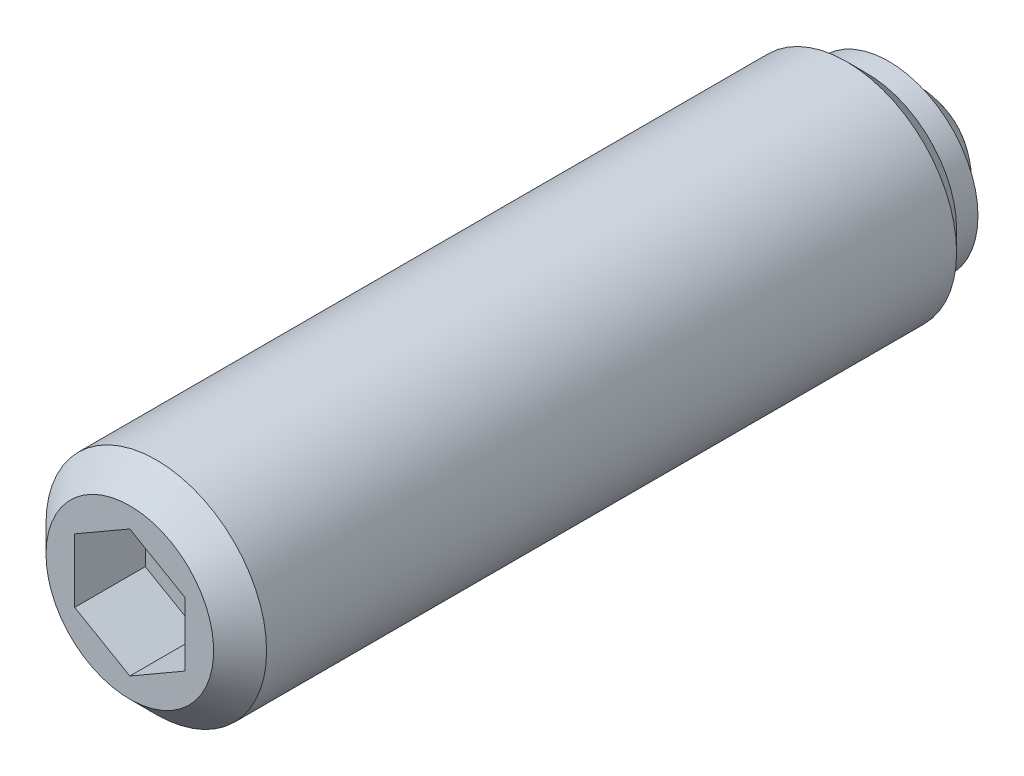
ISO-10303-21;
HEADER;
FILE_DESCRIPTION(('STEP AP214'),'2;1');
FILE_NAME('part.step','',(''),(''),'','','');
FILE_SCHEMA(('AUTOMOTIVE_DESIGN { 1 0 10303 214 1 1 1 1 }'));
ENDSEC;
DATA;
#1=APPLICATION_CONTEXT('core data for automotive mechanical design processes');
#2=APPLICATION_PROTOCOL_DEFINITION('international standard','automotive_design',2000,#1);
#3=PRODUCT_CONTEXT('',#1,'mechanical');
#4=PRODUCT('Part','Part','',(#3));
#5=PRODUCT_RELATED_PRODUCT_CATEGORY('part','',(#4));
#6=PRODUCT_DEFINITION_FORMATION('','',#4);
#7=PRODUCT_DEFINITION_CONTEXT('part definition',#1,'design');
#8=PRODUCT_DEFINITION('design','',#6,#7);
#9=PRODUCT_DEFINITION_SHAPE('','',#8);
#10=(LENGTH_UNIT() NAMED_UNIT(*) SI_UNIT(.MILLI.,.METRE.));
#11=(NAMED_UNIT(*) PLANE_ANGLE_UNIT() SI_UNIT($,.RADIAN.));
#12=(NAMED_UNIT(*) SI_UNIT($,.STERADIAN.) SOLID_ANGLE_UNIT());
#13=UNCERTAINTY_MEASURE_WITH_UNIT(LENGTH_MEASURE(1.E-05),#10,'distance_accuracy_value','');
#14=(GEOMETRIC_REPRESENTATION_CONTEXT(3) GLOBAL_UNCERTAINTY_ASSIGNED_CONTEXT((#13)) GLOBAL_UNIT_ASSIGNED_CONTEXT((#10,
#11,#12)) REPRESENTATION_CONTEXT('',''));
#15=CARTESIAN_POINT('',(0.,0.,0.));
#16=DIRECTION('',(0.,0.,1.));
#17=DIRECTION('',(1.,0.,0.));
#18=AXIS2_PLACEMENT_3D('',#15,#16,#17);
#19=CARTESIAN_POINT('',(0.,0.,33.5));
#20=DIRECTION('',(0.,0.,-1.));
#21=DIRECTION('',(-1.,0.,0.));
#22=AXIS2_PLACEMENT_3D('',#19,#20,#21);
#23=PLANE('',#22);
#24=DIRECTION('',(0.,1.,0.));
#25=VECTOR('',#24,1.);
#26=CARTESIAN_POINT('',(-2.5,-1.44337567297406,33.5));
#27=LINE('',#26,#25);
#28=CARTESIAN_POINT('',(-2.5,-1.44337567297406,33.5));
#29=VERTEX_POINT('',#28);
#30=CARTESIAN_POINT('',(-2.5,1.44337567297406,33.5));
#31=VERTEX_POINT('',#30);
#32=EDGE_CURVE('E80',#29,#31,#27,.T.);
#33=ORIENTED_EDGE('',*,*,#32,.F.);
#34=DIRECTION('',(0.866025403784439,-0.5,0.));
#35=VECTOR('',#34,1.);
#36=CARTESIAN_POINT('',(0.,-2.88675134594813,33.5));
#37=LINE('',#36,#35);
#38=CARTESIAN_POINT('',(0.,-2.88675134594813,33.5));
#39=VERTEX_POINT('',#38);
#40=EDGE_CURVE('E102',#39,#29,#37,.F.);
#41=ORIENTED_EDGE('',*,*,#40,.F.);
#42=DIRECTION('',(-0.866025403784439,-0.5,0.));
#43=VECTOR('',#42,1.);
#44=CARTESIAN_POINT('',(1.25,-2.1650635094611,33.5));
#45=LINE('',#44,#43);
#46=CARTESIAN_POINT('',(2.5,-1.44337567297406,33.5));
#47=VERTEX_POINT('',#46);
#48=EDGE_CURVE('E81',#47,#39,#45,.T.);
#49=ORIENTED_EDGE('',*,*,#48,.F.);
#50=DIRECTION('',(0.,1.,0.));
#51=VECTOR('',#50,1.);
#52=CARTESIAN_POINT('',(2.5,0.,33.5));
#53=LINE('',#52,#51);
#54=CARTESIAN_POINT('',(2.5,1.44337567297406,33.5));
#55=VERTEX_POINT('',#54);
#56=EDGE_CURVE('E64',#55,#47,#53,.F.);
#57=ORIENTED_EDGE('',*,*,#56,.F.);
#58=DIRECTION('',(0.866025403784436,-0.5,0.));
#59=VECTOR('',#58,1.);
#60=CARTESIAN_POINT('',(1.25,2.1650635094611,33.5));
#61=LINE('',#60,#59);
#62=CARTESIAN_POINT('',(0.,2.88675134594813,33.5));
#63=VERTEX_POINT('',#62);
#64=EDGE_CURVE('E67',#63,#55,#61,.T.);
#65=ORIENTED_EDGE('',*,*,#64,.F.);
#66=DIRECTION('',(0.866025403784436,0.5,0.));
#67=VECTOR('',#66,1.);
#68=CARTESIAN_POINT('',(-2.5,1.44337567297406,33.5));
#69=LINE('',#68,#67);
#70=EDGE_CURVE('E69',#31,#63,#69,.T.);
#71=ORIENTED_EDGE('',*,*,#70,.F.);
#72=EDGE_LOOP('',(#33,#41,#49,#57,#65,#71));
#73=FACE_BOUND('',#72,.T.);
#74=ADVANCED_FACE('F14',(#73),#23,.F.);
#75=CARTESIAN_POINT('',(-2.5,-1.44337567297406,33.5));
#76=DIRECTION('',(1.,0.,0.));
#77=DIRECTION('',(0.,0.,-1.));
#78=AXIS2_PLACEMENT_3D('',#75,#76,#77);
#79=PLANE('',#78);
#80=ORIENTED_EDGE('',*,*,#32,.T.);
#81=DIRECTION('',(0.,0.,-1.));
#82=VECTOR('',#81,1.);
#83=CARTESIAN_POINT('',(-2.5,1.44337567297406,33.5));
#84=LINE('',#83,#82);
#85=CARTESIAN_POINT('',(-2.5,1.44337567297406,36.7));
#86=VERTEX_POINT('',#85);
#87=EDGE_CURVE('E79',#86,#31,#84,.T.);
#88=ORIENTED_EDGE('',*,*,#87,.F.);
#89=DIRECTION('',(0.,1.,0.));
#90=VECTOR('',#89,1.);
#91=CARTESIAN_POINT('',(-2.5,0.,36.7));
#92=LINE('',#91,#90);
#93=CARTESIAN_POINT('',(-2.5,-1.44337567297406,36.7));
#94=VERTEX_POINT('',#93);
#95=EDGE_CURVE('E84',#86,#94,#92,.F.);
#96=ORIENTED_EDGE('',*,*,#95,.T.);
#97=DIRECTION('',(0.,0.,-1.));
#98=VECTOR('',#97,1.);
#99=CARTESIAN_POINT('',(-2.5,-1.44337567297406,33.5));
#100=LINE('',#99,#98);
#101=EDGE_CURVE('E96',#29,#94,#100,.F.);
#102=ORIENTED_EDGE('',*,*,#101,.F.);
#103=EDGE_LOOP('',(#80,#88,#96,#102));
#104=FACE_BOUND('',#103,.T.);
#105=ADVANCED_FACE('F169',(#104),#79,.T.);
#106=CARTESIAN_POINT('',(0.,-2.88675134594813,33.5));
#107=DIRECTION('',(0.5,0.866025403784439,0.));
#108=DIRECTION('',(0.866025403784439,-0.5,0.));
#109=AXIS2_PLACEMENT_3D('',#106,#107,#108);
#110=PLANE('',#109);
#111=ORIENTED_EDGE('',*,*,#40,.T.);
#112=ORIENTED_EDGE('',*,*,#101,.T.);
#113=DIRECTION('',(0.866025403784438,-0.5,0.));
#114=VECTOR('',#113,1.);
#115=CARTESIAN_POINT('',(-2.5,-1.44337567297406,36.7));
#116=LINE('',#115,#114);
#117=CARTESIAN_POINT('',(0.,-2.88675134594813,36.7));
#118=VERTEX_POINT('',#117);
#119=EDGE_CURVE('E85',#94,#118,#116,.T.);
#120=ORIENTED_EDGE('',*,*,#119,.T.);
#121=DIRECTION('',(0.,0.,-1.));
#122=VECTOR('',#121,1.);
#123=CARTESIAN_POINT('',(0.,-2.88675134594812,33.5));
#124=LINE('',#123,#122);
#125=EDGE_CURVE('E94',#39,#118,#124,.F.);
#126=ORIENTED_EDGE('',*,*,#125,.F.);
#127=EDGE_LOOP('',(#111,#112,#120,#126));
#128=FACE_BOUND('',#127,.T.);
#129=ADVANCED_FACE('F173',(#128),#110,.T.);
#130=CARTESIAN_POINT('',(2.5,-1.44337567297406,33.5));
#131=DIRECTION('',(-0.5,0.866025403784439,0.));
#132=DIRECTION('',(0.866025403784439,0.5,0.));
#133=AXIS2_PLACEMENT_3D('',#130,#131,#132);
#134=PLANE('',#133);
#135=ORIENTED_EDGE('',*,*,#48,.T.);
#136=ORIENTED_EDGE('',*,*,#125,.T.);
#137=DIRECTION('',(0.866025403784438,0.5,0.));
#138=VECTOR('',#137,1.);
#139=CARTESIAN_POINT('',(0.,-2.88675134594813,36.7));
#140=LINE('',#139,#138);
#141=CARTESIAN_POINT('',(2.5,-1.44337567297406,36.7));
#142=VERTEX_POINT('',#141);
#143=EDGE_CURVE('E108',#118,#142,#140,.T.);
#144=ORIENTED_EDGE('',*,*,#143,.T.);
#145=DIRECTION('',(0.,0.,1.));
#146=VECTOR('',#145,1.);
#147=CARTESIAN_POINT('',(2.5,-1.44337567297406,33.5));
#148=LINE('',#147,#146);
#149=EDGE_CURVE('E91',#47,#142,#148,.T.);
#150=ORIENTED_EDGE('',*,*,#149,.F.);
#151=EDGE_LOOP('',(#135,#136,#144,#150));
#152=FACE_BOUND('',#151,.T.);
#153=ADVANCED_FACE('F178',(#152),#134,.T.);
#154=CARTESIAN_POINT('',(2.5,1.44337567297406,33.5));
#155=DIRECTION('',(-1.,0.,0.));
#156=DIRECTION('',(0.,0.,1.));
#157=AXIS2_PLACEMENT_3D('',#154,#155,#156);
#158=PLANE('',#157);
#159=ORIENTED_EDGE('',*,*,#56,.T.);
#160=ORIENTED_EDGE('',*,*,#149,.T.);
#161=DIRECTION('',(0.,1.,0.));
#162=VECTOR('',#161,1.);
#163=CARTESIAN_POINT('',(2.5,0.,36.7));
#164=LINE('',#163,#162);
#165=CARTESIAN_POINT('',(2.5,1.44337567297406,36.7));
#166=VERTEX_POINT('',#165);
#167=EDGE_CURVE('E110',#142,#166,#164,.T.);
#168=ORIENTED_EDGE('',*,*,#167,.T.);
#169=DIRECTION('',(0.,0.,-1.));
#170=VECTOR('',#169,1.);
#171=CARTESIAN_POINT('',(2.5,1.44337567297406,33.5));
#172=LINE('',#171,#170);
#173=EDGE_CURVE('E87',#55,#166,#172,.F.);
#174=ORIENTED_EDGE('',*,*,#173,.F.);
#175=EDGE_LOOP('',(#159,#160,#168,#174));
#176=FACE_BOUND('',#175,.T.);
#177=ADVANCED_FACE('F184',(#176),#158,.T.);
#178=CARTESIAN_POINT('',(0.,2.88675134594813,33.5));
#179=DIRECTION('',(-0.5,-0.866025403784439,0.));
#180=DIRECTION('',(-0.866025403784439,0.5,0.));
#181=AXIS2_PLACEMENT_3D('',#178,#179,#180);
#182=PLANE('',#181);
#183=ORIENTED_EDGE('',*,*,#64,.T.);
#184=ORIENTED_EDGE('',*,*,#173,.T.);
#185=DIRECTION('',(-0.866025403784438,0.5,0.));
#186=VECTOR('',#185,1.);
#187=CARTESIAN_POINT('',(2.5,1.44337567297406,36.7));
#188=LINE('',#187,#186);
#189=CARTESIAN_POINT('',(0.,2.88675134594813,36.7));
#190=VERTEX_POINT('',#189);
#191=EDGE_CURVE('E31',#166,#190,#188,.T.);
#192=ORIENTED_EDGE('',*,*,#191,.T.);
#193=DIRECTION('',(0.,0.,-1.));
#194=VECTOR('',#193,1.);
#195=CARTESIAN_POINT('',(0.,2.88675134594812,33.5));
#196=LINE('',#195,#194);
#197=EDGE_CURVE('E77',#63,#190,#196,.F.);
#198=ORIENTED_EDGE('',*,*,#197,.F.);
#199=EDGE_LOOP('',(#183,#184,#192,#198));
#200=FACE_BOUND('',#199,.T.);
#201=ADVANCED_FACE('F83',(#200),#182,.T.);
#202=CARTESIAN_POINT('',(-2.5,1.44337567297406,33.5));
#203=DIRECTION('',(0.5,-0.866025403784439,0.));
#204=DIRECTION('',(-0.866025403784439,-0.5,0.));
#205=AXIS2_PLACEMENT_3D('',#202,#203,#204);
#206=PLANE('',#205);
#207=ORIENTED_EDGE('',*,*,#70,.T.);
#208=ORIENTED_EDGE('',*,*,#197,.T.);
#209=DIRECTION('',(-0.866025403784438,-0.5,0.));
#210=VECTOR('',#209,1.);
#211=CARTESIAN_POINT('',(0.,2.88675134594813,36.7));
#212=LINE('',#211,#210);
#213=EDGE_CURVE('E113',#190,#86,#212,.T.);
#214=ORIENTED_EDGE('',*,*,#213,.T.);
#215=ORIENTED_EDGE('',*,*,#87,.T.);
#216=EDGE_LOOP('',(#207,#208,#214,#215));
#217=FACE_BOUND('',#216,.T.);
#218=ADVANCED_FACE('F75',(#217),#206,.T.);
#219=CARTESIAN_POINT('',(0.,0.,36.7));
#220=DIRECTION('',(0.,0.,-1.));
#221=DIRECTION('',(-1.,0.,0.));
#222=AXIS2_PLACEMENT_3D('',#219,#220,#221);
#223=PLANE('',#222);
#224=ORIENTED_EDGE('',*,*,#191,.F.);
#225=ORIENTED_EDGE('',*,*,#167,.F.);
#226=ORIENTED_EDGE('',*,*,#143,.F.);
#227=ORIENTED_EDGE('',*,*,#119,.F.);
#228=ORIENTED_EDGE('',*,*,#95,.F.);
#229=ORIENTED_EDGE('',*,*,#213,.F.);
#230=EDGE_LOOP('',(#224,#225,#226,#227,#228,#229));
#231=FACE_BOUND('',#230,.T.);
#232=CARTESIAN_POINT('',(0.,0.,36.7));
#233=DIRECTION('',(0.,0.,-1.));
#234=DIRECTION('',(-1.,0.,0.));
#235=AXIS2_PLACEMENT_3D('',#232,#233,#234);
#236=CIRCLE('',#235,3.8000000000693);
#237=CARTESIAN_POINT('',(-3.8000000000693,0.,36.7));
#238=VERTEX_POINT('',#237);
#239=EDGE_CURVE('E17',#238,#238,#236,.T.);
#240=ORIENTED_EDGE('',*,*,#239,.F.);
#241=EDGE_LOOP('',(#240));
#242=FACE_BOUND('',#241,.T.);
#243=ADVANCED_FACE('F193',(#231,#242),#223,.F.);
#244=CARTESIAN_POINT('',(0.,0.,35.5000000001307));
#245=DIRECTION('',(0.,0.,-1.));
#246=DIRECTION('',(-1.,0.,0.));
#247=AXIS2_PLACEMENT_3D('',#244,#245,#246);
#248=CONICAL_SURFACE('',#247,4.99999999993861,0.785398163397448);
#249=ORIENTED_EDGE('',*,*,#239,.T.);
#250=EDGE_LOOP('',(#249));
#251=FACE_BOUND('',#250,.T.);
#252=CARTESIAN_POINT('',(0.,0.,35.5));
#253=DIRECTION('',(0.,0.,1.));
#254=DIRECTION('',(1.,0.,0.));
#255=AXIS2_PLACEMENT_3D('',#252,#253,#254);
#256=CIRCLE('',#255,5.);
#257=CARTESIAN_POINT('',(5.,0.,35.5));
#258=VERTEX_POINT('',#257);
#259=EDGE_CURVE('E9',#258,#258,#256,.F.);
#260=ORIENTED_EDGE('',*,*,#259,.F.);
#261=EDGE_LOOP('',(#260));
#262=FACE_BOUND('',#261,.T.);
#263=ADVANCED_FACE('F165',(#251,#262),#248,.T.);
#264=CARTESIAN_POINT('',(0.,0.,25.3));
#265=DIRECTION('',(0.,0.,1.));
#266=DIRECTION('',(1.,0.,0.));
#267=AXIS2_PLACEMENT_3D('',#264,#265,#266);
#268=CYLINDRICAL_SURFACE('',#267,5.);
#269=ORIENTED_EDGE('',*,*,#259,.T.);
#270=EDGE_LOOP('',(#269));
#271=FACE_BOUND('',#270,.T.);
#272=CARTESIAN_POINT('',(0.,0.,4.22));
#273=DIRECTION('',(0.,0.,1.));
#274=DIRECTION('',(1.,0.,0.));
#275=AXIS2_PLACEMENT_3D('',#272,#273,#274);
#276=CIRCLE('',#275,5.);
#277=CARTESIAN_POINT('',(5.,0.,4.22));
#278=VERTEX_POINT('',#277);
#279=EDGE_CURVE('E128',#278,#278,#276,.T.);
#280=ORIENTED_EDGE('',*,*,#279,.T.);
#281=EDGE_LOOP('',(#280));
#282=FACE_BOUND('',#281,.T.);
#283=ADVANCED_FACE('F132',(#271,#282),#268,.T.);
#284=CARTESIAN_POINT('',(0.,0.,3.5));
#285=DIRECTION('',(0.,0.,1.));
#286=DIRECTION('',(0.,1.,0.));
#287=AXIS2_PLACEMENT_3D('',#284,#285,#286);
#288=SPHERICAL_SURFACE('',#287,3.5);
#289=CARTESIAN_POINT('',(0.,0.,2.3));
#290=DIRECTION('',(0.,0.,1.));
#291=DIRECTION('',(1.,0.,0.));
#292=AXIS2_PLACEMENT_3D('',#289,#290,#291);
#293=CIRCLE('',#292,3.28785644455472);
#294=CARTESIAN_POINT('',(3.28785644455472,0.,2.3));
#295=VERTEX_POINT('',#294);
#296=EDGE_CURVE('E71',#295,#295,#293,.T.);
#297=ORIENTED_EDGE('',*,*,#296,.F.);
#298=EDGE_LOOP('',(#297));
#299=FACE_BOUND('',#298,.T.);
#300=ADVANCED_FACE('F155',(#299),#288,.T.);
#301=CARTESIAN_POINT('',(0.,3.28785644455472,2.3));
#302=DIRECTION('',(0.,0.,1.));
#303=DIRECTION('',(1.,0.,0.));
#304=AXIS2_PLACEMENT_3D('',#301,#302,#303);
#305=PLANE('',#304);
#306=CARTESIAN_POINT('',(0.,0.,2.3));
#307=DIRECTION('',(0.,0.,1.));
#308=DIRECTION('',(1.,0.,0.));
#309=AXIS2_PLACEMENT_3D('',#306,#307,#308);
#310=CIRCLE('',#309,4.05000000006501);
#311=CARTESIAN_POINT('',(4.05000000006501,0.,2.3));
#312=VERTEX_POINT('',#311);
#313=EDGE_CURVE('E119',#312,#312,#310,.T.);
#314=ORIENTED_EDGE('',*,*,#313,.F.);
#315=EDGE_LOOP('',(#314));
#316=FACE_BOUND('',#315,.T.);
#317=ORIENTED_EDGE('',*,*,#296,.T.);
#318=EDGE_LOOP('',(#317));
#319=FACE_BOUND('',#318,.T.);
#320=ADVANCED_FACE('F149',(#316,#319),#305,.F.);
#321=CARTESIAN_POINT('',(0.,0.,40.0345981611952));
#322=DIRECTION('',(0.,0.,1.));
#323=DIRECTION('',(1.,0.,0.));
#324=AXIS2_PLACEMENT_3D('',#321,#322,#323);
#325=CYLINDRICAL_SURFACE('',#324,4.05000000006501);
#326=CARTESIAN_POINT('',(0.,0.,3.30000000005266));
#327=DIRECTION('',(0.,0.,1.));
#328=DIRECTION('',(1.,0.,0.));
#329=AXIS2_PLACEMENT_3D('',#326,#327,#328);
#330=CIRCLE('',#329,4.05000000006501);
#331=CARTESIAN_POINT('',(4.05000000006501,0.,3.30000000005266));
#332=VERTEX_POINT('',#331);
#333=EDGE_CURVE('E122',#332,#332,#330,.T.);
#334=ORIENTED_EDGE('',*,*,#333,.F.);
#335=EDGE_LOOP('',(#334));
#336=FACE_BOUND('',#335,.T.);
#337=ORIENTED_EDGE('',*,*,#313,.T.);
#338=EDGE_LOOP('',(#337));
#339=FACE_BOUND('',#338,.T.);
#340=ADVANCED_FACE('F143',(#336,#339),#325,.T.);
#341=CARTESIAN_POINT('',(0.,4.05000000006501,3.30000000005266));
#342=DIRECTION('',(0.,0.,1.));
#343=DIRECTION('',(1.,0.,0.));
#344=AXIS2_PLACEMENT_3D('',#341,#342,#343);
#345=PLANE('',#344);
#346=CARTESIAN_POINT('',(0.,0.,3.30000000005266));
#347=DIRECTION('',(0.,0.,1.));
#348=DIRECTION('',(1.,0.,0.));
#349=AXIS2_PLACEMENT_3D('',#346,#347,#348);
#350=CIRCLE('',#349,4.08000000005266);
#351=CARTESIAN_POINT('',(4.08000000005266,0.,3.30000000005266));
#352=VERTEX_POINT('',#351);
#353=EDGE_CURVE('E125',#352,#352,#350,.T.);
#354=ORIENTED_EDGE('',*,*,#353,.F.);
#355=EDGE_LOOP('',(#354));
#356=FACE_BOUND('',#355,.T.);
#357=ORIENTED_EDGE('',*,*,#333,.T.);
#358=EDGE_LOOP('',(#357));
#359=FACE_BOUND('',#358,.T.);
#360=ADVANCED_FACE('F137',(#356,#359),#345,.F.);
#361=CARTESIAN_POINT('',(0.,0.,3.30000000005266));
#362=DIRECTION('',(0.,0.,1.));
#363=DIRECTION('',(1.,0.,0.));
#364=AXIS2_PLACEMENT_3D('',#361,#362,#363);
#365=CONICAL_SURFACE('',#364,4.08000000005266,0.785398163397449);
#366=ORIENTED_EDGE('',*,*,#279,.F.);
#367=EDGE_LOOP('',(#366));
#368=FACE_BOUND('',#367,.T.);
#369=ORIENTED_EDGE('',*,*,#353,.T.);
#370=EDGE_LOOP('',(#369));
#371=FACE_BOUND('',#370,.T.);
#372=ADVANCED_FACE('F134',(#368,#371),#365,.T.);
#373=CLOSED_SHELL('',(#74,#105,#129,#153,#177,#201,#218,#243,#263,#283,#300,#320,#340,#360,#372));
#374=MANIFOLD_SOLID_BREP('B1',#373);
#375=ADVANCED_BREP_SHAPE_REPRESENTATION('',(#18,#374),#14);
#376=SHAPE_DEFINITION_REPRESENTATION(#9,#375);
ENDSEC;
END-ISO-10303-21;
